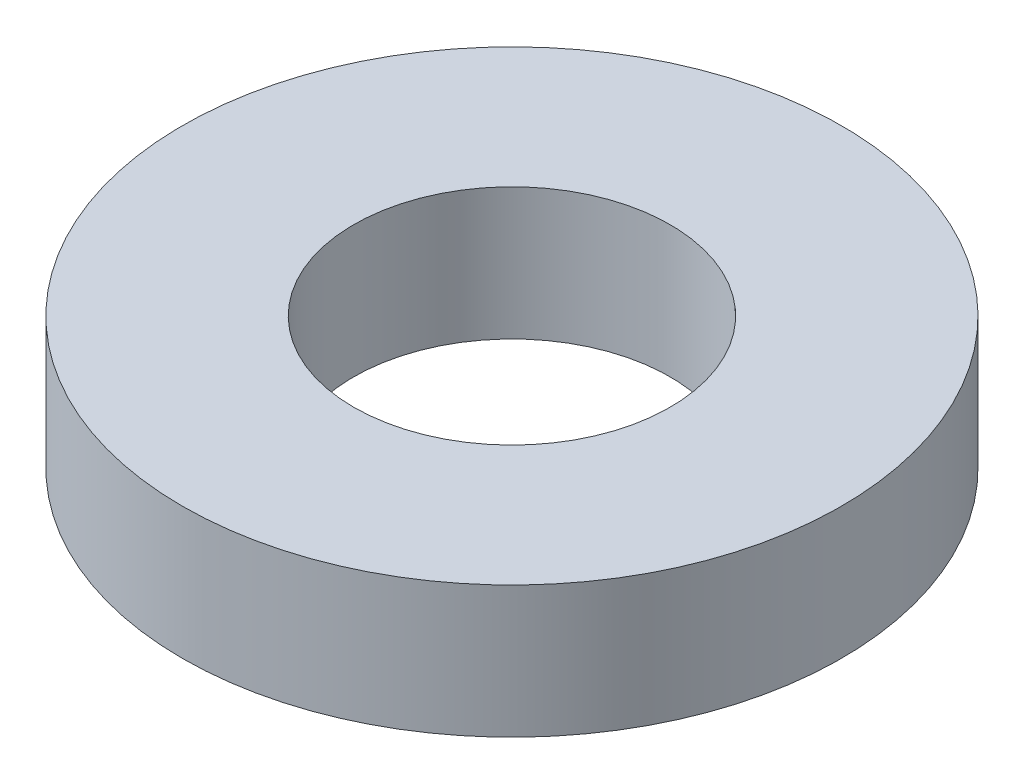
from build123d import *

# Parameters (mm, degrees)
ESQUISSE1_R      = 50
ESQUISSE1_R_2    = 24
EXTRUSION1_DEPTH = 20


with BuildPart() as part:
    # Esquisse1 → Extrusion1 (new body)
    with BuildSketch(Plane(origin=(0, 0, 0), x_dir=(1, 0, 0), z_dir=(0, 1, 0))):
        with Locations(Location((0, 0, 0), (0, 0, 270))):
            Circle(ESQUISSE1_R)
        with Locations(Location((0, 0, 0), (0, 0, 270))):
            Circle(ESQUISSE1_R_2, mode=Mode.SUBTRACT)
    extrude(amount=EXTRUSION1_DEPTH)


solid = part.part
